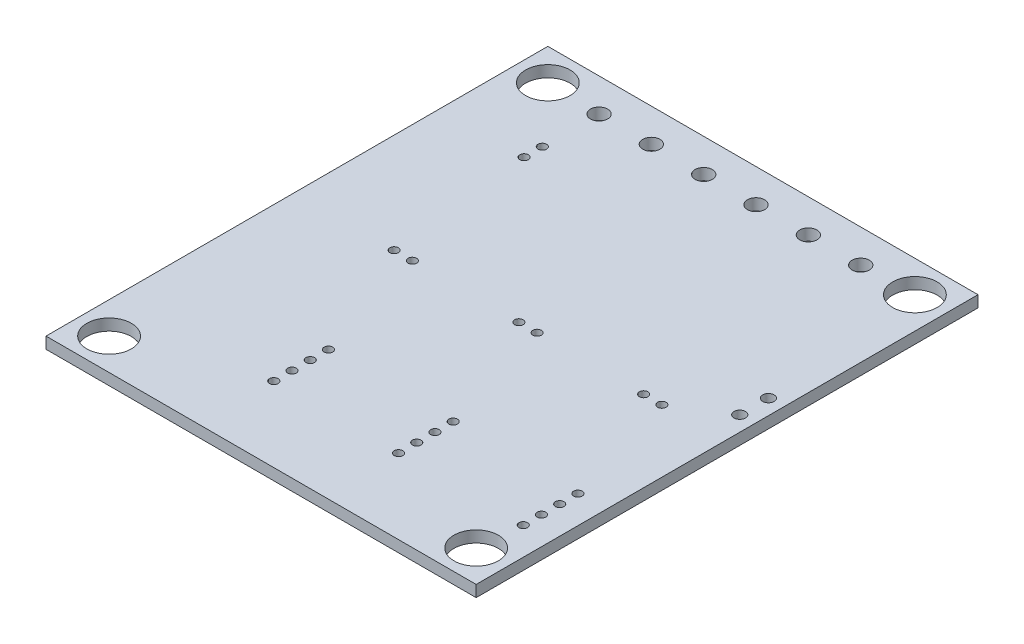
ISO-10303-21;
HEADER;
FILE_DESCRIPTION(('STEP AP214'),'2;1');
FILE_NAME('part.step','',(''),(''),'','','');
FILE_SCHEMA(('AUTOMOTIVE_DESIGN { 1 0 10303 214 1 1 1 1 }'));
ENDSEC;
DATA;
#1=APPLICATION_CONTEXT('core data for automotive mechanical design processes');
#2=APPLICATION_PROTOCOL_DEFINITION('international standard','automotive_design',2000,#1);
#3=PRODUCT_CONTEXT('',#1,'mechanical');
#4=PRODUCT('Part','Part','',(#3));
#5=PRODUCT_RELATED_PRODUCT_CATEGORY('part','',(#4));
#6=PRODUCT_DEFINITION_FORMATION('','',#4);
#7=PRODUCT_DEFINITION_CONTEXT('part definition',#1,'design');
#8=PRODUCT_DEFINITION('design','',#6,#7);
#9=PRODUCT_DEFINITION_SHAPE('','',#8);
#10=(LENGTH_UNIT() NAMED_UNIT(*) SI_UNIT(.MILLI.,.METRE.));
#11=(NAMED_UNIT(*) PLANE_ANGLE_UNIT() SI_UNIT($,.RADIAN.));
#12=(NAMED_UNIT(*) SI_UNIT($,.STERADIAN.) SOLID_ANGLE_UNIT());
#13=UNCERTAINTY_MEASURE_WITH_UNIT(LENGTH_MEASURE(1.E-05),#10,'distance_accuracy_value','');
#14=(GEOMETRIC_REPRESENTATION_CONTEXT(3) GLOBAL_UNCERTAINTY_ASSIGNED_CONTEXT((#13)) GLOBAL_UNIT_ASSIGNED_CONTEXT((#10,
#11,#12)) REPRESENTATION_CONTEXT('',''));
#15=CARTESIAN_POINT('',(0.,0.,0.));
#16=DIRECTION('',(0.,0.,1.));
#17=DIRECTION('',(1.,0.,0.));
#18=AXIS2_PLACEMENT_3D('',#15,#16,#17);
#19=CARTESIAN_POINT('',(-15.,0.,17.5));
#20=DIRECTION('',(0.,1.,0.));
#21=DIRECTION('',(0.,0.,1.));
#22=AXIS2_PLACEMENT_3D('',#19,#20,#21);
#23=PLANE('',#22);
#24=DIRECTION('',(0.,0.,-1.));
#25=VECTOR('',#24,1.);
#26=CARTESIAN_POINT('',(15.,0.,-17.5));
#27=LINE('',#26,#25);
#28=CARTESIAN_POINT('',(15.,0.,-17.5));
#29=VERTEX_POINT('',#28);
#30=CARTESIAN_POINT('',(15.,0.,17.5));
#31=VERTEX_POINT('',#30);
#32=EDGE_CURVE('E58',#29,#31,#27,.F.);
#33=ORIENTED_EDGE('',*,*,#32,.F.);
#34=DIRECTION('',(-1.,0.,0.));
#35=VECTOR('',#34,1.);
#36=CARTESIAN_POINT('',(-15.,0.,-17.5));
#37=LINE('',#36,#35);
#38=CARTESIAN_POINT('',(-15.,0.,-17.5));
#39=VERTEX_POINT('',#38);
#40=EDGE_CURVE('E53',#39,#29,#37,.F.);
#41=ORIENTED_EDGE('',*,*,#40,.F.);
#42=DIRECTION('',(0.,0.,1.));
#43=VECTOR('',#42,1.);
#44=CARTESIAN_POINT('',(-15.,0.,-17.5));
#45=LINE('',#44,#43);
#46=CARTESIAN_POINT('',(-15.,0.,17.5));
#47=VERTEX_POINT('',#46);
#48=EDGE_CURVE('E71',#47,#39,#45,.F.);
#49=ORIENTED_EDGE('',*,*,#48,.F.);
#50=DIRECTION('',(1.,0.,0.));
#51=VECTOR('',#50,1.);
#52=CARTESIAN_POINT('',(-15.,0.,17.5));
#53=LINE('',#52,#51);
#54=EDGE_CURVE('E67',#31,#47,#53,.F.);
#55=ORIENTED_EDGE('',*,*,#54,.F.);
#56=EDGE_LOOP('',(#33,#41,#49,#55));
#57=FACE_BOUND('',#56,.T.);
#58=CARTESIAN_POINT('',(-9.12499999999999,0.,-15.1951690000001));
#59=DIRECTION('',(0.,1.,0.));
#60=DIRECTION('',(0.,0.,1.));
#61=AXIS2_PLACEMENT_3D('',#58,#59,#60);
#62=CIRCLE('',#61,0.6);
#63=CARTESIAN_POINT('',(-9.12499999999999,0.,-14.5951690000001));
#64=VERTEX_POINT('',#63);
#65=EDGE_CURVE('E75',#64,#64,#62,.F.);
#66=ORIENTED_EDGE('',*,*,#65,.T.);
#67=EDGE_LOOP('',(#66));
#68=FACE_BOUND('',#67,.T.);
#69=CARTESIAN_POINT('',(-5.47500000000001,0.,-15.1951690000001));
#70=DIRECTION('',(0.,1.,0.));
#71=DIRECTION('',(0.,0.,1.));
#72=AXIS2_PLACEMENT_3D('',#69,#70,#71);
#73=CIRCLE('',#72,0.6);
#74=CARTESIAN_POINT('',(-5.47500000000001,0.,-14.5951690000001));
#75=VERTEX_POINT('',#74);
#76=EDGE_CURVE('E183',#75,#75,#73,.F.);
#77=ORIENTED_EDGE('',*,*,#76,.T.);
#78=EDGE_LOOP('',(#77));
#79=FACE_BOUND('',#78,.T.);
#80=CARTESIAN_POINT('',(-1.82499999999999,-1.2490009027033E-13,-15.1951690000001));
#81=DIRECTION('',(0.,1.,0.));
#82=DIRECTION('',(0.,0.,1.));
#83=AXIS2_PLACEMENT_3D('',#80,#81,#82);
#84=CIRCLE('',#83,0.6);
#85=CARTESIAN_POINT('',(-1.82499999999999,-1.24828540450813E-13,-14.5951690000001));
#86=VERTEX_POINT('',#85);
#87=EDGE_CURVE('E186',#86,#86,#84,.F.);
#88=ORIENTED_EDGE('',*,*,#87,.T.);
#89=EDGE_LOOP('',(#88));
#90=FACE_BOUND('',#89,.T.);
#91=CARTESIAN_POINT('',(1.82499999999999,0.,-15.1951690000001));
#92=DIRECTION('',(0.,1.,0.));
#93=DIRECTION('',(0.,0.,1.));
#94=AXIS2_PLACEMENT_3D('',#91,#92,#93);
#95=CIRCLE('',#94,0.6);
#96=CARTESIAN_POINT('',(1.82499999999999,0.,-14.5951690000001));
#97=VERTEX_POINT('',#96);
#98=EDGE_CURVE('E189',#97,#97,#95,.F.);
#99=ORIENTED_EDGE('',*,*,#98,.T.);
#100=EDGE_LOOP('',(#99));
#101=FACE_BOUND('',#100,.T.);
#102=CARTESIAN_POINT('',(5.47500000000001,0.,-15.1951690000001));
#103=DIRECTION('',(0.,1.,0.));
#104=DIRECTION('',(0.,0.,1.));
#105=AXIS2_PLACEMENT_3D('',#102,#103,#104);
#106=CIRCLE('',#105,0.6);
#107=CARTESIAN_POINT('',(5.47500000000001,0.,-14.5951690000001));
#108=VERTEX_POINT('',#107);
#109=EDGE_CURVE('E192',#108,#108,#106,.F.);
#110=ORIENTED_EDGE('',*,*,#109,.T.);
#111=EDGE_LOOP('',(#110));
#112=FACE_BOUND('',#111,.T.);
#113=CARTESIAN_POINT('',(9.12499999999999,-1.2490009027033E-13,-15.195169));
#114=DIRECTION('',(0.,1.,0.));
#115=DIRECTION('',(0.,0.,1.));
#116=AXIS2_PLACEMENT_3D('',#113,#114,#115);
#117=CIRCLE('',#116,0.6);
#118=CARTESIAN_POINT('',(9.12499999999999,-1.24828540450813E-13,-14.595169));
#119=VERTEX_POINT('',#118);
#120=EDGE_CURVE('E195',#119,#119,#117,.F.);
#121=ORIENTED_EDGE('',*,*,#120,.T.);
#122=EDGE_LOOP('',(#121));
#123=FACE_BOUND('',#122,.T.);
#124=CARTESIAN_POINT('',(-12.8,0.,-15.3));
#125=DIRECTION('',(0.,1.,0.));
#126=DIRECTION('',(0.,0.,1.));
#127=AXIS2_PLACEMENT_3D('',#124,#125,#126);
#128=CIRCLE('',#127,1.55);
#129=CARTESIAN_POINT('',(-12.8,0.,-13.75));
#130=VERTEX_POINT('',#129);
#131=EDGE_CURVE('E198',#130,#130,#128,.F.);
#132=ORIENTED_EDGE('',*,*,#131,.T.);
#133=EDGE_LOOP('',(#132));
#134=FACE_BOUND('',#133,.T.);
#135=CARTESIAN_POINT('',(-12.8,-1.2490009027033E-13,15.3));
#136=DIRECTION('',(0.,1.,0.));
#137=DIRECTION('',(0.,0.,1.));
#138=AXIS2_PLACEMENT_3D('',#135,#136,#137);
#139=CIRCLE('',#138,1.55);
#140=CARTESIAN_POINT('',(-12.8,-1.24715253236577E-13,16.85));
#141=VERTEX_POINT('',#140);
#142=EDGE_CURVE('E201',#141,#141,#139,.F.);
#143=ORIENTED_EDGE('',*,*,#142,.T.);
#144=EDGE_LOOP('',(#143));
#145=FACE_BOUND('',#144,.T.);
#146=CARTESIAN_POINT('',(12.8,-1.2490009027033E-13,15.3));
#147=DIRECTION('',(0.,1.,0.));
#148=DIRECTION('',(0.,0.,1.));
#149=AXIS2_PLACEMENT_3D('',#146,#147,#148);
#150=CIRCLE('',#149,1.55);
#151=CARTESIAN_POINT('',(12.8,-1.24715253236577E-13,16.85));
#152=VERTEX_POINT('',#151);
#153=EDGE_CURVE('E204',#152,#152,#150,.F.);
#154=ORIENTED_EDGE('',*,*,#153,.T.);
#155=EDGE_LOOP('',(#154));
#156=FACE_BOUND('',#155,.T.);
#157=CARTESIAN_POINT('',(12.8,0.,-15.3));
#158=DIRECTION('',(0.,1.,0.));
#159=DIRECTION('',(0.,0.,1.));
#160=AXIS2_PLACEMENT_3D('',#157,#158,#159);
#161=CIRCLE('',#160,1.55);
#162=CARTESIAN_POINT('',(12.8,0.,-13.75));
#163=VERTEX_POINT('',#162);
#164=EDGE_CURVE('E207',#163,#163,#161,.F.);
#165=ORIENTED_EDGE('',*,*,#164,.T.);
#166=EDGE_LOOP('',(#165));
#167=FACE_BOUND('',#166,.T.);
#168=CARTESIAN_POINT('',(1.92386300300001,0.,0.174116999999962));
#169=DIRECTION('',(0.,1.,0.));
#170=DIRECTION('',(0.,0.,1.));
#171=AXIS2_PLACEMENT_3D('',#168,#169,#170);
#172=CIRCLE('',#171,0.299999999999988);
#173=CARTESIAN_POINT('',(1.92386300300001,0.,0.474116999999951));
#174=VERTEX_POINT('',#173);
#175=EDGE_CURVE('E210',#174,#174,#172,.F.);
#176=ORIENTED_EDGE('',*,*,#175,.T.);
#177=EDGE_LOOP('',(#176));
#178=FACE_BOUND('',#177,.T.);
#179=CARTESIAN_POINT('',(13.062017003,0.,12.2762009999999));
#180=DIRECTION('',(0.,1.,0.));
#181=DIRECTION('',(0.,0.,1.));
#182=AXIS2_PLACEMENT_3D('',#179,#180,#181);
#183=CIRCLE('',#182,0.299999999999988);
#184=CARTESIAN_POINT('',(13.062017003,0.,12.5762009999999));
#185=VERTEX_POINT('',#184);
#186=EDGE_CURVE('E213',#185,#185,#183,.F.);
#187=ORIENTED_EDGE('',*,*,#186,.T.);
#188=EDGE_LOOP('',(#187));
#189=FACE_BOUND('',#188,.T.);
#190=CARTESIAN_POINT('',(13.062017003,0.,11.0062009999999));
#191=DIRECTION('',(0.,1.,0.));
#192=DIRECTION('',(0.,0.,1.));
#193=AXIS2_PLACEMENT_3D('',#190,#191,#192);
#194=CIRCLE('',#193,0.299999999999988);
#195=CARTESIAN_POINT('',(13.062017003,0.,11.3062009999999));
#196=VERTEX_POINT('',#195);
#197=EDGE_CURVE('E216',#196,#196,#194,.F.);
#198=ORIENTED_EDGE('',*,*,#197,.T.);
#199=EDGE_LOOP('',(#198));
#200=FACE_BOUND('',#199,.T.);
#201=CARTESIAN_POINT('',(13.062017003,-1.2490009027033E-13,9.73620099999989));
#202=DIRECTION('',(0.,1.,0.));
#203=DIRECTION('',(0.,0.,1.));
#204=AXIS2_PLACEMENT_3D('',#201,#202,#203);
#205=CIRCLE('',#204,0.299999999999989);
#206=CARTESIAN_POINT('',(13.062017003,-1.24864315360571E-13,10.0362009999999));
#207=VERTEX_POINT('',#206);
#208=EDGE_CURVE('E219',#207,#207,#205,.F.);
#209=ORIENTED_EDGE('',*,*,#208,.T.);
#210=EDGE_LOOP('',(#209));
#211=FACE_BOUND('',#210,.T.);
#212=CARTESIAN_POINT('',(13.062017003,-1.2490009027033E-13,8.46620099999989));
#213=DIRECTION('',(0.,1.,0.));
#214=DIRECTION('',(0.,0.,1.));
#215=AXIS2_PLACEMENT_3D('',#212,#213,#214);
#216=CIRCLE('',#215,0.299999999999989);
#217=CARTESIAN_POINT('',(13.062017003,-1.24864315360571E-13,8.76620099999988));
#218=VERTEX_POINT('',#217);
#219=EDGE_CURVE('E222',#218,#218,#216,.F.);
#220=ORIENTED_EDGE('',*,*,#219,.T.);
#221=EDGE_LOOP('',(#220));
#222=FACE_BOUND('',#221,.T.);
#223=CARTESIAN_POINT('',(4.362517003,0.,12.2762009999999));
#224=DIRECTION('',(0.,1.,0.));
#225=DIRECTION('',(0.,0.,1.));
#226=AXIS2_PLACEMENT_3D('',#223,#224,#225);
#227=CIRCLE('',#226,0.299999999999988);
#228=CARTESIAN_POINT('',(4.362517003,0.,12.5762009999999));
#229=VERTEX_POINT('',#228);
#230=EDGE_CURVE('E225',#229,#229,#227,.F.);
#231=ORIENTED_EDGE('',*,*,#230,.T.);
#232=EDGE_LOOP('',(#231));
#233=FACE_BOUND('',#232,.T.);
#234=CARTESIAN_POINT('',(4.362517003,0.,11.0062009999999));
#235=DIRECTION('',(0.,1.,0.));
#236=DIRECTION('',(0.,0.,1.));
#237=AXIS2_PLACEMENT_3D('',#234,#235,#236);
#238=CIRCLE('',#237,0.299999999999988);
#239=CARTESIAN_POINT('',(4.362517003,0.,11.3062009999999));
#240=VERTEX_POINT('',#239);
#241=EDGE_CURVE('E228',#240,#240,#238,.F.);
#242=ORIENTED_EDGE('',*,*,#241,.T.);
#243=EDGE_LOOP('',(#242));
#244=FACE_BOUND('',#243,.T.);
#245=CARTESIAN_POINT('',(4.362517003,-1.2490009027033E-13,9.73620099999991));
#246=DIRECTION('',(0.,1.,0.));
#247=DIRECTION('',(0.,0.,1.));
#248=AXIS2_PLACEMENT_3D('',#245,#246,#247);
#249=CIRCLE('',#248,0.299999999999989);
#250=CARTESIAN_POINT('',(4.362517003,-1.24864315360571E-13,10.0362009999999));
#251=VERTEX_POINT('',#250);
#252=EDGE_CURVE('E231',#251,#251,#249,.F.);
#253=ORIENTED_EDGE('',*,*,#252,.T.);
#254=EDGE_LOOP('',(#253));
#255=FACE_BOUND('',#254,.T.);
#256=CARTESIAN_POINT('',(4.362517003,-1.2490009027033E-13,8.4662009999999));
#257=DIRECTION('',(0.,1.,0.));
#258=DIRECTION('',(0.,0.,1.));
#259=AXIS2_PLACEMENT_3D('',#256,#257,#258);
#260=CIRCLE('',#259,0.299999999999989);
#261=CARTESIAN_POINT('',(4.362517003,-1.24864315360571E-13,8.76620099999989));
#262=VERTEX_POINT('',#261);
#263=EDGE_CURVE('E234',#262,#262,#260,.F.);
#264=ORIENTED_EDGE('',*,*,#263,.T.);
#265=EDGE_LOOP('',(#264));
#266=FACE_BOUND('',#265,.T.);
#267=CARTESIAN_POINT('',(-4.33698299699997,-1.2490009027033E-13,8.4662009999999));
#268=DIRECTION('',(0.,1.,0.));
#269=DIRECTION('',(0.,0.,1.));
#270=AXIS2_PLACEMENT_3D('',#267,#268,#269);
#271=CIRCLE('',#270,0.299999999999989);
#272=CARTESIAN_POINT('',(-4.33698299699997,-1.24864315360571E-13,8.76620099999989));
#273=VERTEX_POINT('',#272);
#274=EDGE_CURVE('E237',#273,#273,#271,.F.);
#275=ORIENTED_EDGE('',*,*,#274,.T.);
#276=EDGE_LOOP('',(#275));
#277=FACE_BOUND('',#276,.T.);
#278=CARTESIAN_POINT('',(-4.33698299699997,-1.2490009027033E-13,9.73620099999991));
#279=DIRECTION('',(0.,1.,0.));
#280=DIRECTION('',(0.,0.,1.));
#281=AXIS2_PLACEMENT_3D('',#278,#279,#280);
#282=CIRCLE('',#281,0.299999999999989);
#283=CARTESIAN_POINT('',(-4.33698299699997,-1.24864315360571E-13,10.0362009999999));
#284=VERTEX_POINT('',#283);
#285=EDGE_CURVE('E240',#284,#284,#282,.F.);
#286=ORIENTED_EDGE('',*,*,#285,.T.);
#287=EDGE_LOOP('',(#286));
#288=FACE_BOUND('',#287,.T.);
#289=CARTESIAN_POINT('',(-4.33698299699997,0.,11.0062009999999));
#290=DIRECTION('',(0.,1.,0.));
#291=DIRECTION('',(0.,0.,1.));
#292=AXIS2_PLACEMENT_3D('',#289,#290,#291);
#293=CIRCLE('',#292,0.299999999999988);
#294=CARTESIAN_POINT('',(-4.33698299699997,0.,11.3062009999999));
#295=VERTEX_POINT('',#294);
#296=EDGE_CURVE('E243',#295,#295,#293,.F.);
#297=ORIENTED_EDGE('',*,*,#296,.T.);
#298=EDGE_LOOP('',(#297));
#299=FACE_BOUND('',#298,.T.);
#300=CARTESIAN_POINT('',(-4.33698299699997,0.,12.2762009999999));
#301=DIRECTION('',(0.,1.,0.));
#302=DIRECTION('',(0.,0.,1.));
#303=AXIS2_PLACEMENT_3D('',#300,#301,#302);
#304=CIRCLE('',#303,0.299999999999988);
#305=CARTESIAN_POINT('',(-4.33698299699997,0.,12.5762009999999));
#306=VERTEX_POINT('',#305);
#307=EDGE_CURVE('E246',#306,#306,#304,.F.);
#308=ORIENTED_EDGE('',*,*,#307,.T.);
#309=EDGE_LOOP('',(#308));
#310=FACE_BOUND('',#309,.T.);
#311=CARTESIAN_POINT('',(10.623363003,0.,0.174116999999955));
#312=DIRECTION('',(0.,1.,0.));
#313=DIRECTION('',(0.,0.,1.));
#314=AXIS2_PLACEMENT_3D('',#311,#312,#313);
#315=CIRCLE('',#314,0.299999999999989);
#316=CARTESIAN_POINT('',(10.623363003,0.,0.474116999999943));
#317=VERTEX_POINT('',#316);
#318=EDGE_CURVE('E249',#317,#317,#315,.F.);
#319=ORIENTED_EDGE('',*,*,#318,.T.);
#320=EDGE_LOOP('',(#319));
#321=FACE_BOUND('',#320,.T.);
#322=CARTESIAN_POINT('',(9.35336300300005,-1.2490009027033E-13,0.174116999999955));
#323=DIRECTION('',(0.,1.,0.));
#324=DIRECTION('',(0.,0.,1.));
#325=AXIS2_PLACEMENT_3D('',#322,#323,#324);
#326=CIRCLE('',#325,0.299999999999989);
#327=CARTESIAN_POINT('',(9.35336300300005,-1.24864315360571E-13,0.474116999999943));
#328=VERTEX_POINT('',#327);
#329=EDGE_CURVE('E252',#328,#328,#326,.F.);
#330=ORIENTED_EDGE('',*,*,#329,.T.);
#331=EDGE_LOOP('',(#330));
#332=FACE_BOUND('',#331,.T.);
#333=CARTESIAN_POINT('',(0.653863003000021,0.,0.174116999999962));
#334=DIRECTION('',(0.,1.,0.));
#335=DIRECTION('',(0.,0.,1.));
#336=AXIS2_PLACEMENT_3D('',#333,#334,#335);
#337=CIRCLE('',#336,0.299999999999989);
#338=CARTESIAN_POINT('',(0.653863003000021,0.,0.474116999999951));
#339=VERTEX_POINT('',#338);
#340=EDGE_CURVE('E255',#339,#339,#337,.F.);
#341=ORIENTED_EDGE('',*,*,#340,.T.);
#342=EDGE_LOOP('',(#341));
#343=FACE_BOUND('',#342,.T.);
#344=CARTESIAN_POINT('',(-6.77563699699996,0.,0.174116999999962));
#345=DIRECTION('',(0.,1.,0.));
#346=DIRECTION('',(0.,0.,1.));
#347=AXIS2_PLACEMENT_3D('',#344,#345,#346);
#348=CIRCLE('',#347,0.299999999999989);
#349=CARTESIAN_POINT('',(-6.77563699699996,0.,0.474116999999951));
#350=VERTEX_POINT('',#349);
#351=EDGE_CURVE('E258',#350,#350,#348,.F.);
#352=ORIENTED_EDGE('',*,*,#351,.T.);
#353=EDGE_LOOP('',(#352));
#354=FACE_BOUND('',#353,.T.);
#355=CARTESIAN_POINT('',(-8.04563699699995,0.,0.174116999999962));
#356=DIRECTION('',(0.,1.,0.));
#357=DIRECTION('',(0.,0.,1.));
#358=AXIS2_PLACEMENT_3D('',#355,#356,#357);
#359=CIRCLE('',#358,0.299999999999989);
#360=CARTESIAN_POINT('',(-8.04563699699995,0.,0.474116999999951));
#361=VERTEX_POINT('',#360);
#362=EDGE_CURVE('E261',#361,#361,#359,.F.);
#363=ORIENTED_EDGE('',*,*,#362,.T.);
#364=EDGE_LOOP('',(#363));
#365=FACE_BOUND('',#364,.T.);
#366=CARTESIAN_POINT('',(-9.131232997,0.,-9.9736910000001));
#367=DIRECTION('',(0.,1.,0.));
#368=DIRECTION('',(0.,0.,1.));
#369=AXIS2_PLACEMENT_3D('',#366,#367,#368);
#370=CIRCLE('',#369,0.299999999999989);
#371=CARTESIAN_POINT('',(-9.131232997,0.,-9.67369100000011));
#372=VERTEX_POINT('',#371);
#373=EDGE_CURVE('E264',#372,#372,#370,.F.);
#374=ORIENTED_EDGE('',*,*,#373,.T.);
#375=EDGE_LOOP('',(#374));
#376=FACE_BOUND('',#375,.T.);
#377=CARTESIAN_POINT('',(-9.131232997,0.,-11.2436910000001));
#378=DIRECTION('',(0.,1.,0.));
#379=DIRECTION('',(0.,0.,1.));
#380=AXIS2_PLACEMENT_3D('',#377,#378,#379);
#381=CIRCLE('',#380,0.299999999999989);
#382=CARTESIAN_POINT('',(-9.131232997,0.,-10.9436910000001));
#383=VERTEX_POINT('',#382);
#384=EDGE_CURVE('E267',#383,#383,#381,.F.);
#385=ORIENTED_EDGE('',*,*,#384,.T.);
#386=EDGE_LOOP('',(#385));
#387=FACE_BOUND('',#386,.T.);
#388=CARTESIAN_POINT('',(13.94,-1.2490009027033E-13,-3.94093900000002));
#389=DIRECTION('',(0.,1.,0.));
#390=DIRECTION('',(0.,0.,1.));
#391=AXIS2_PLACEMENT_3D('',#388,#389,#390);
#392=CIRCLE('',#391,0.4);
#393=CARTESIAN_POINT('',(13.94,-1.24852390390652E-13,-3.54093900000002));
#394=VERTEX_POINT('',#393);
#395=EDGE_CURVE('E269',#394,#394,#392,.F.);
#396=ORIENTED_EDGE('',*,*,#395,.T.);
#397=EDGE_LOOP('',(#396));
#398=FACE_BOUND('',#397,.T.);
#399=CARTESIAN_POINT('',(13.94,0.,-1.94093900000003));
#400=DIRECTION('',(0.,1.,0.));
#401=DIRECTION('',(0.,0.,1.));
#402=AXIS2_PLACEMENT_3D('',#399,#400,#401);
#403=CIRCLE('',#402,0.4);
#404=CARTESIAN_POINT('',(13.94,0.,-1.54093900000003));
#405=VERTEX_POINT('',#404);
#406=EDGE_CURVE('E20',#405,#405,#403,.F.);
#407=ORIENTED_EDGE('',*,*,#406,.T.);
#408=EDGE_LOOP('',(#407));
#409=FACE_BOUND('',#408,.T.);
#410=ADVANCED_FACE('F17',(#57,#68,#79,#90,#101,#112,#123,#134,#145,#156,#167,#178,#189,#200,
#211,#222,#233,#244,#255,#266,#277,#288,#299,#310,#321,#332,#343,#354,#365,#376,#387,#398,#409),
#23,.T.);
#411=CARTESIAN_POINT('',(13.94,-1.,-1.94093900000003));
#412=DIRECTION('',(0.,1.,0.));
#413=DIRECTION('',(0.,0.,1.));
#414=AXIS2_PLACEMENT_3D('',#411,#412,#413);
#415=CYLINDRICAL_SURFACE('',#414,0.4);
#416=CARTESIAN_POINT('',(13.94,-0.800000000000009,-1.94093900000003));
#417=DIRECTION('',(0.,1.,0.));
#418=DIRECTION('',(0.,0.,1.));
#419=AXIS2_PLACEMENT_3D('',#416,#417,#418);
#420=CIRCLE('',#419,0.4);
#421=CARTESIAN_POINT('',(13.94,-0.800000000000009,-1.54093900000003));
#422=VERTEX_POINT('',#421);
#423=EDGE_CURVE('E177',#422,#422,#420,.F.);
#424=ORIENTED_EDGE('',*,*,#423,.T.);
#425=EDGE_LOOP('',(#424));
#426=FACE_BOUND('',#425,.T.);
#427=ORIENTED_EDGE('',*,*,#406,.F.);
#428=EDGE_LOOP('',(#427));
#429=FACE_BOUND('',#428,.T.);
#430=ADVANCED_FACE('F277',(#426,#429),#415,.F.);
#431=CARTESIAN_POINT('',(13.94,-1.00000000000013,-3.94093900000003));
#432=DIRECTION('',(0.,1.,0.));
#433=DIRECTION('',(0.,0.,1.));
#434=AXIS2_PLACEMENT_3D('',#431,#432,#433);
#435=CYLINDRICAL_SURFACE('',#434,0.4);
#436=CARTESIAN_POINT('',(13.94,-0.80000000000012,-3.94093900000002));
#437=DIRECTION('',(0.,1.,0.));
#438=DIRECTION('',(0.,0.,1.));
#439=AXIS2_PLACEMENT_3D('',#436,#437,#438);
#440=CIRCLE('',#439,0.4);
#441=CARTESIAN_POINT('',(13.94,-0.80000000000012,-3.54093900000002));
#442=VERTEX_POINT('',#441);
#443=EDGE_CURVE('E174',#442,#442,#440,.F.);
#444=ORIENTED_EDGE('',*,*,#443,.T.);
#445=EDGE_LOOP('',(#444));
#446=FACE_BOUND('',#445,.T.);
#447=ORIENTED_EDGE('',*,*,#395,.F.);
#448=EDGE_LOOP('',(#447));
#449=FACE_BOUND('',#448,.T.);
#450=ADVANCED_FACE('F279',(#446,#449),#435,.F.);
#451=CARTESIAN_POINT('',(-9.131232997,0.,-11.2436910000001));
#452=DIRECTION('',(0.,1.,0.));
#453=DIRECTION('',(0.,0.,1.));
#454=AXIS2_PLACEMENT_3D('',#451,#452,#453);
#455=CYLINDRICAL_SURFACE('',#454,0.299999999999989);
#456=CARTESIAN_POINT('',(-9.131232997,-0.800000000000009,-11.2436910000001));
#457=DIRECTION('',(0.,1.,0.));
#458=DIRECTION('',(0.,0.,1.));
#459=AXIS2_PLACEMENT_3D('',#456,#457,#458);
#460=CIRCLE('',#459,0.299999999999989);
#461=CARTESIAN_POINT('',(-9.131232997,-0.800000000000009,-10.9436910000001));
#462=VERTEX_POINT('',#461);
#463=EDGE_CURVE('E171',#462,#462,#460,.F.);
#464=ORIENTED_EDGE('',*,*,#463,.T.);
#465=EDGE_LOOP('',(#464));
#466=FACE_BOUND('',#465,.T.);
#467=ORIENTED_EDGE('',*,*,#384,.F.);
#468=EDGE_LOOP('',(#467));
#469=FACE_BOUND('',#468,.T.);
#470=ADVANCED_FACE('F286',(#466,#469),#455,.F.);
#471=CARTESIAN_POINT('',(-9.131232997,0.,-9.9736910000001));
#472=DIRECTION('',(0.,1.,0.));
#473=DIRECTION('',(0.,0.,1.));
#474=AXIS2_PLACEMENT_3D('',#471,#472,#473);
#475=CYLINDRICAL_SURFACE('',#474,0.299999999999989);
#476=CARTESIAN_POINT('',(-9.131232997,-0.799999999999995,-9.97369100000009));
#477=DIRECTION('',(0.,1.,0.));
#478=DIRECTION('',(0.,0.,1.));
#479=AXIS2_PLACEMENT_3D('',#476,#477,#478);
#480=CIRCLE('',#479,0.299999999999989);
#481=CARTESIAN_POINT('',(-9.131232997,-0.799999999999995,-9.6736910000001));
#482=VERTEX_POINT('',#481);
#483=EDGE_CURVE('E168',#482,#482,#480,.F.);
#484=ORIENTED_EDGE('',*,*,#483,.T.);
#485=EDGE_LOOP('',(#484));
#486=FACE_BOUND('',#485,.T.);
#487=ORIENTED_EDGE('',*,*,#373,.F.);
#488=EDGE_LOOP('',(#487));
#489=FACE_BOUND('',#488,.T.);
#490=ADVANCED_FACE('F419',(#486,#489),#475,.F.);
#491=CARTESIAN_POINT('',(-8.04563699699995,0.,0.174116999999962));
#492=DIRECTION('',(0.,1.,0.));
#493=DIRECTION('',(0.,0.,1.));
#494=AXIS2_PLACEMENT_3D('',#491,#492,#493);
#495=CYLINDRICAL_SURFACE('',#494,0.299999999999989);
#496=CARTESIAN_POINT('',(-8.04563699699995,-0.799999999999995,0.174116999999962));
#497=DIRECTION('',(0.,1.,0.));
#498=DIRECTION('',(0.,0.,1.));
#499=AXIS2_PLACEMENT_3D('',#496,#497,#498);
#500=CIRCLE('',#499,0.299999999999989);
#501=CARTESIAN_POINT('',(-8.04563699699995,-0.799999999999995,0.474116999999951));
#502=VERTEX_POINT('',#501);
#503=EDGE_CURVE('E165',#502,#502,#500,.F.);
#504=ORIENTED_EDGE('',*,*,#503,.T.);
#505=EDGE_LOOP('',(#504));
#506=FACE_BOUND('',#505,.T.);
#507=ORIENTED_EDGE('',*,*,#362,.F.);
#508=EDGE_LOOP('',(#507));
#509=FACE_BOUND('',#508,.T.);
#510=ADVANCED_FACE('F415',(#506,#509),#495,.F.);
#511=CARTESIAN_POINT('',(-6.77563699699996,0.,0.174116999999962));
#512=DIRECTION('',(0.,1.,0.));
#513=DIRECTION('',(0.,0.,1.));
#514=AXIS2_PLACEMENT_3D('',#511,#512,#513);
#515=CYLINDRICAL_SURFACE('',#514,0.299999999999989);
#516=CARTESIAN_POINT('',(-6.77563699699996,-0.800000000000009,0.174116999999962));
#517=DIRECTION('',(0.,1.,0.));
#518=DIRECTION('',(0.,0.,1.));
#519=AXIS2_PLACEMENT_3D('',#516,#517,#518);
#520=CIRCLE('',#519,0.299999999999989);
#521=CARTESIAN_POINT('',(-6.77563699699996,-0.800000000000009,0.474116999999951));
#522=VERTEX_POINT('',#521);
#523=EDGE_CURVE('E162',#522,#522,#520,.F.);
#524=ORIENTED_EDGE('',*,*,#523,.T.);
#525=EDGE_LOOP('',(#524));
#526=FACE_BOUND('',#525,.T.);
#527=ORIENTED_EDGE('',*,*,#351,.F.);
#528=EDGE_LOOP('',(#527));
#529=FACE_BOUND('',#528,.T.);
#530=ADVANCED_FACE('F411',(#526,#529),#515,.F.);
#531=CARTESIAN_POINT('',(0.653863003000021,0.,0.174116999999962));
#532=DIRECTION('',(0.,1.,0.));
#533=DIRECTION('',(0.,0.,1.));
#534=AXIS2_PLACEMENT_3D('',#531,#532,#533);
#535=CYLINDRICAL_SURFACE('',#534,0.299999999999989);
#536=CARTESIAN_POINT('',(0.653863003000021,-0.799999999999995,0.174116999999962));
#537=DIRECTION('',(0.,1.,0.));
#538=DIRECTION('',(0.,0.,1.));
#539=AXIS2_PLACEMENT_3D('',#536,#537,#538);
#540=CIRCLE('',#539,0.299999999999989);
#541=CARTESIAN_POINT('',(0.653863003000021,-0.799999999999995,0.474116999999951));
#542=VERTEX_POINT('',#541);
#543=EDGE_CURVE('E159',#542,#542,#540,.F.);
#544=ORIENTED_EDGE('',*,*,#543,.T.);
#545=EDGE_LOOP('',(#544));
#546=FACE_BOUND('',#545,.T.);
#547=ORIENTED_EDGE('',*,*,#340,.F.);
#548=EDGE_LOOP('',(#547));
#549=FACE_BOUND('',#548,.T.);
#550=ADVANCED_FACE('F407',(#546,#549),#535,.F.);
#551=CARTESIAN_POINT('',(9.35336300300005,-1.2490009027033E-13,0.174116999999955));
#552=DIRECTION('',(0.,1.,0.));
#553=DIRECTION('',(0.,0.,1.));
#554=AXIS2_PLACEMENT_3D('',#551,#552,#553);
#555=CYLINDRICAL_SURFACE('',#554,0.299999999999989);
#556=CARTESIAN_POINT('',(9.35336300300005,-0.80000000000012,0.174116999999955));
#557=DIRECTION('',(0.,1.,0.));
#558=DIRECTION('',(0.,0.,1.));
#559=AXIS2_PLACEMENT_3D('',#556,#557,#558);
#560=CIRCLE('',#559,0.299999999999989);
#561=CARTESIAN_POINT('',(9.35336300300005,-0.80000000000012,0.474116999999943));
#562=VERTEX_POINT('',#561);
#563=EDGE_CURVE('E156',#562,#562,#560,.F.);
#564=ORIENTED_EDGE('',*,*,#563,.T.);
#565=EDGE_LOOP('',(#564));
#566=FACE_BOUND('',#565,.T.);
#567=ORIENTED_EDGE('',*,*,#329,.F.);
#568=EDGE_LOOP('',(#567));
#569=FACE_BOUND('',#568,.T.);
#570=ADVANCED_FACE('F403',(#566,#569),#555,.F.);
#571=CARTESIAN_POINT('',(10.623363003,0.,0.174116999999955));
#572=DIRECTION('',(0.,1.,0.));
#573=DIRECTION('',(0.,0.,1.));
#574=AXIS2_PLACEMENT_3D('',#571,#572,#573);
#575=CYLINDRICAL_SURFACE('',#574,0.299999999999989);
#576=CARTESIAN_POINT('',(10.623363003,-0.800000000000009,0.174116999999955));
#577=DIRECTION('',(0.,1.,0.));
#578=DIRECTION('',(0.,0.,1.));
#579=AXIS2_PLACEMENT_3D('',#576,#577,#578);
#580=CIRCLE('',#579,0.299999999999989);
#581=CARTESIAN_POINT('',(10.623363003,-0.800000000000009,0.474116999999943));
#582=VERTEX_POINT('',#581);
#583=EDGE_CURVE('E153',#582,#582,#580,.F.);
#584=ORIENTED_EDGE('',*,*,#583,.T.);
#585=EDGE_LOOP('',(#584));
#586=FACE_BOUND('',#585,.T.);
#587=ORIENTED_EDGE('',*,*,#318,.F.);
#588=EDGE_LOOP('',(#587));
#589=FACE_BOUND('',#588,.T.);
#590=ADVANCED_FACE('F399',(#586,#589),#575,.F.);
#591=CARTESIAN_POINT('',(-4.33698299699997,0.,12.2762009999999));
#592=DIRECTION('',(0.,1.,0.));
#593=DIRECTION('',(0.,0.,1.));
#594=AXIS2_PLACEMENT_3D('',#591,#592,#593);
#595=CYLINDRICAL_SURFACE('',#594,0.299999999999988);
#596=CARTESIAN_POINT('',(-4.33698299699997,-0.800000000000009,12.2762009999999));
#597=DIRECTION('',(0.,1.,0.));
#598=DIRECTION('',(0.,0.,1.));
#599=AXIS2_PLACEMENT_3D('',#596,#597,#598);
#600=CIRCLE('',#599,0.299999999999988);
#601=CARTESIAN_POINT('',(-4.33698299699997,-0.800000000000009,12.5762009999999));
#602=VERTEX_POINT('',#601);
#603=EDGE_CURVE('E150',#602,#602,#600,.F.);
#604=ORIENTED_EDGE('',*,*,#603,.T.);
#605=EDGE_LOOP('',(#604));
#606=FACE_BOUND('',#605,.T.);
#607=ORIENTED_EDGE('',*,*,#307,.F.);
#608=EDGE_LOOP('',(#607));
#609=FACE_BOUND('',#608,.T.);
#610=ADVANCED_FACE('F395',(#606,#609),#595,.F.);
#611=CARTESIAN_POINT('',(-4.33698299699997,0.,11.0062009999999));
#612=DIRECTION('',(0.,1.,0.));
#613=DIRECTION('',(0.,0.,1.));
#614=AXIS2_PLACEMENT_3D('',#611,#612,#613);
#615=CYLINDRICAL_SURFACE('',#614,0.299999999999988);
#616=CARTESIAN_POINT('',(-4.33698299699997,-0.799999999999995,11.0062009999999));
#617=DIRECTION('',(0.,1.,0.));
#618=DIRECTION('',(0.,0.,1.));
#619=AXIS2_PLACEMENT_3D('',#616,#617,#618);
#620=CIRCLE('',#619,0.299999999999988);
#621=CARTESIAN_POINT('',(-4.33698299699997,-0.799999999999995,11.3062009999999));
#622=VERTEX_POINT('',#621);
#623=EDGE_CURVE('E147',#622,#622,#620,.F.);
#624=ORIENTED_EDGE('',*,*,#623,.T.);
#625=EDGE_LOOP('',(#624));
#626=FACE_BOUND('',#625,.T.);
#627=ORIENTED_EDGE('',*,*,#296,.F.);
#628=EDGE_LOOP('',(#627));
#629=FACE_BOUND('',#628,.T.);
#630=ADVANCED_FACE('F391',(#626,#629),#615,.F.);
#631=CARTESIAN_POINT('',(-4.33698299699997,-1.2490009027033E-13,9.73620099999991));
#632=DIRECTION('',(0.,1.,0.));
#633=DIRECTION('',(0.,0.,1.));
#634=AXIS2_PLACEMENT_3D('',#631,#632,#633);
#635=CYLINDRICAL_SURFACE('',#634,0.299999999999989);
#636=CARTESIAN_POINT('',(-4.33698299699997,-0.80000000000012,9.73620099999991));
#637=DIRECTION('',(0.,1.,0.));
#638=DIRECTION('',(0.,0.,1.));
#639=AXIS2_PLACEMENT_3D('',#636,#637,#638);
#640=CIRCLE('',#639,0.299999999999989);
#641=CARTESIAN_POINT('',(-4.33698299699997,-0.80000000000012,10.0362009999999));
#642=VERTEX_POINT('',#641);
#643=EDGE_CURVE('E144',#642,#642,#640,.F.);
#644=ORIENTED_EDGE('',*,*,#643,.T.);
#645=EDGE_LOOP('',(#644));
#646=FACE_BOUND('',#645,.T.);
#647=ORIENTED_EDGE('',*,*,#285,.F.);
#648=EDGE_LOOP('',(#647));
#649=FACE_BOUND('',#648,.T.);
#650=ADVANCED_FACE('F387',(#646,#649),#635,.F.);
#651=CARTESIAN_POINT('',(-4.33698299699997,-1.2490009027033E-13,8.4662009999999));
#652=DIRECTION('',(0.,1.,0.));
#653=DIRECTION('',(0.,0.,1.));
#654=AXIS2_PLACEMENT_3D('',#651,#652,#653);
#655=CYLINDRICAL_SURFACE('',#654,0.299999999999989);
#656=CARTESIAN_POINT('',(-4.33698299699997,-0.80000000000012,8.4662009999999));
#657=DIRECTION('',(0.,1.,0.));
#658=DIRECTION('',(0.,0.,1.));
#659=AXIS2_PLACEMENT_3D('',#656,#657,#658);
#660=CIRCLE('',#659,0.299999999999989);
#661=CARTESIAN_POINT('',(-4.33698299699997,-0.80000000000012,8.76620099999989));
#662=VERTEX_POINT('',#661);
#663=EDGE_CURVE('E141',#662,#662,#660,.F.);
#664=ORIENTED_EDGE('',*,*,#663,.T.);
#665=EDGE_LOOP('',(#664));
#666=FACE_BOUND('',#665,.T.);
#667=ORIENTED_EDGE('',*,*,#274,.F.);
#668=EDGE_LOOP('',(#667));
#669=FACE_BOUND('',#668,.T.);
#670=ADVANCED_FACE('F383',(#666,#669),#655,.F.);
#671=CARTESIAN_POINT('',(4.362517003,-1.2490009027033E-13,8.4662009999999));
#672=DIRECTION('',(0.,1.,0.));
#673=DIRECTION('',(0.,0.,1.));
#674=AXIS2_PLACEMENT_3D('',#671,#672,#673);
#675=CYLINDRICAL_SURFACE('',#674,0.299999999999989);
#676=CARTESIAN_POINT('',(4.362517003,-0.80000000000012,8.4662009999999));
#677=DIRECTION('',(0.,1.,0.));
#678=DIRECTION('',(0.,0.,1.));
#679=AXIS2_PLACEMENT_3D('',#676,#677,#678);
#680=CIRCLE('',#679,0.299999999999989);
#681=CARTESIAN_POINT('',(4.362517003,-0.80000000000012,8.76620099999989));
#682=VERTEX_POINT('',#681);
#683=EDGE_CURVE('E138',#682,#682,#680,.F.);
#684=ORIENTED_EDGE('',*,*,#683,.T.);
#685=EDGE_LOOP('',(#684));
#686=FACE_BOUND('',#685,.T.);
#687=ORIENTED_EDGE('',*,*,#263,.F.);
#688=EDGE_LOOP('',(#687));
#689=FACE_BOUND('',#688,.T.);
#690=ADVANCED_FACE('F379',(#686,#689),#675,.F.);
#691=CARTESIAN_POINT('',(4.362517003,-1.2490009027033E-13,9.73620099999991));
#692=DIRECTION('',(0.,1.,0.));
#693=DIRECTION('',(0.,0.,1.));
#694=AXIS2_PLACEMENT_3D('',#691,#692,#693);
#695=CYLINDRICAL_SURFACE('',#694,0.299999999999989);
#696=CARTESIAN_POINT('',(4.362517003,-0.80000000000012,9.73620099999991));
#697=DIRECTION('',(0.,1.,0.));
#698=DIRECTION('',(0.,0.,1.));
#699=AXIS2_PLACEMENT_3D('',#696,#697,#698);
#700=CIRCLE('',#699,0.299999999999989);
#701=CARTESIAN_POINT('',(4.362517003,-0.80000000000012,10.0362009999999));
#702=VERTEX_POINT('',#701);
#703=EDGE_CURVE('E135',#702,#702,#700,.F.);
#704=ORIENTED_EDGE('',*,*,#703,.T.);
#705=EDGE_LOOP('',(#704));
#706=FACE_BOUND('',#705,.T.);
#707=ORIENTED_EDGE('',*,*,#252,.F.);
#708=EDGE_LOOP('',(#707));
#709=FACE_BOUND('',#708,.T.);
#710=ADVANCED_FACE('F375',(#706,#709),#695,.F.);
#711=CARTESIAN_POINT('',(4.362517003,0.,11.0062009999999));
#712=DIRECTION('',(0.,1.,0.));
#713=DIRECTION('',(0.,0.,1.));
#714=AXIS2_PLACEMENT_3D('',#711,#712,#713);
#715=CYLINDRICAL_SURFACE('',#714,0.299999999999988);
#716=CARTESIAN_POINT('',(4.362517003,-0.799999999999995,11.0062009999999));
#717=DIRECTION('',(0.,1.,0.));
#718=DIRECTION('',(0.,0.,1.));
#719=AXIS2_PLACEMENT_3D('',#716,#717,#718);
#720=CIRCLE('',#719,0.299999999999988);
#721=CARTESIAN_POINT('',(4.362517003,-0.799999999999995,11.3062009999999));
#722=VERTEX_POINT('',#721);
#723=EDGE_CURVE('E132',#722,#722,#720,.F.);
#724=ORIENTED_EDGE('',*,*,#723,.T.);
#725=EDGE_LOOP('',(#724));
#726=FACE_BOUND('',#725,.T.);
#727=ORIENTED_EDGE('',*,*,#241,.F.);
#728=EDGE_LOOP('',(#727));
#729=FACE_BOUND('',#728,.T.);
#730=ADVANCED_FACE('F371',(#726,#729),#715,.F.);
#731=CARTESIAN_POINT('',(4.362517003,0.,12.2762009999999));
#732=DIRECTION('',(0.,1.,0.));
#733=DIRECTION('',(0.,0.,1.));
#734=AXIS2_PLACEMENT_3D('',#731,#732,#733);
#735=CYLINDRICAL_SURFACE('',#734,0.299999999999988);
#736=CARTESIAN_POINT('',(4.362517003,-0.800000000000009,12.2762009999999));
#737=DIRECTION('',(0.,1.,0.));
#738=DIRECTION('',(0.,0.,1.));
#739=AXIS2_PLACEMENT_3D('',#736,#737,#738);
#740=CIRCLE('',#739,0.299999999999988);
#741=CARTESIAN_POINT('',(4.362517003,-0.800000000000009,12.5762009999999));
#742=VERTEX_POINT('',#741);
#743=EDGE_CURVE('E129',#742,#742,#740,.F.);
#744=ORIENTED_EDGE('',*,*,#743,.T.);
#745=EDGE_LOOP('',(#744));
#746=FACE_BOUND('',#745,.T.);
#747=ORIENTED_EDGE('',*,*,#230,.F.);
#748=EDGE_LOOP('',(#747));
#749=FACE_BOUND('',#748,.T.);
#750=ADVANCED_FACE('F367',(#746,#749),#735,.F.);
#751=CARTESIAN_POINT('',(13.062017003,-1.2490009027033E-13,8.46620099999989));
#752=DIRECTION('',(0.,1.,0.));
#753=DIRECTION('',(0.,0.,1.));
#754=AXIS2_PLACEMENT_3D('',#751,#752,#753);
#755=CYLINDRICAL_SURFACE('',#754,0.299999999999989);
#756=CARTESIAN_POINT('',(13.062017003,-0.80000000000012,8.46620099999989));
#757=DIRECTION('',(0.,1.,0.));
#758=DIRECTION('',(0.,0.,1.));
#759=AXIS2_PLACEMENT_3D('',#756,#757,#758);
#760=CIRCLE('',#759,0.299999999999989);
#761=CARTESIAN_POINT('',(13.062017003,-0.80000000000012,8.76620099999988));
#762=VERTEX_POINT('',#761);
#763=EDGE_CURVE('E126',#762,#762,#760,.F.);
#764=ORIENTED_EDGE('',*,*,#763,.T.);
#765=EDGE_LOOP('',(#764));
#766=FACE_BOUND('',#765,.T.);
#767=ORIENTED_EDGE('',*,*,#219,.F.);
#768=EDGE_LOOP('',(#767));
#769=FACE_BOUND('',#768,.T.);
#770=ADVANCED_FACE('F363',(#766,#769),#755,.F.);
#771=CARTESIAN_POINT('',(13.062017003,-1.2490009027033E-13,9.73620099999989));
#772=DIRECTION('',(0.,1.,0.));
#773=DIRECTION('',(0.,0.,1.));
#774=AXIS2_PLACEMENT_3D('',#771,#772,#773);
#775=CYLINDRICAL_SURFACE('',#774,0.299999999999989);
#776=CARTESIAN_POINT('',(13.062017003,-0.80000000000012,9.73620099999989));
#777=DIRECTION('',(0.,1.,0.));
#778=DIRECTION('',(0.,0.,1.));
#779=AXIS2_PLACEMENT_3D('',#776,#777,#778);
#780=CIRCLE('',#779,0.299999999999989);
#781=CARTESIAN_POINT('',(13.062017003,-0.80000000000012,10.0362009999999));
#782=VERTEX_POINT('',#781);
#783=EDGE_CURVE('E123',#782,#782,#780,.F.);
#784=ORIENTED_EDGE('',*,*,#783,.T.);
#785=EDGE_LOOP('',(#784));
#786=FACE_BOUND('',#785,.T.);
#787=ORIENTED_EDGE('',*,*,#208,.F.);
#788=EDGE_LOOP('',(#787));
#789=FACE_BOUND('',#788,.T.);
#790=ADVANCED_FACE('F359',(#786,#789),#775,.F.);
#791=CARTESIAN_POINT('',(13.062017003,0.,11.0062009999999));
#792=DIRECTION('',(0.,1.,0.));
#793=DIRECTION('',(0.,0.,1.));
#794=AXIS2_PLACEMENT_3D('',#791,#792,#793);
#795=CYLINDRICAL_SURFACE('',#794,0.299999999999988);
#796=CARTESIAN_POINT('',(13.062017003,-0.799999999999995,11.0062009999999));
#797=DIRECTION('',(0.,1.,0.));
#798=DIRECTION('',(0.,0.,1.));
#799=AXIS2_PLACEMENT_3D('',#796,#797,#798);
#800=CIRCLE('',#799,0.299999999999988);
#801=CARTESIAN_POINT('',(13.062017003,-0.799999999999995,11.3062009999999));
#802=VERTEX_POINT('',#801);
#803=EDGE_CURVE('E120',#802,#802,#800,.F.);
#804=ORIENTED_EDGE('',*,*,#803,.T.);
#805=EDGE_LOOP('',(#804));
#806=FACE_BOUND('',#805,.T.);
#807=ORIENTED_EDGE('',*,*,#197,.F.);
#808=EDGE_LOOP('',(#807));
#809=FACE_BOUND('',#808,.T.);
#810=ADVANCED_FACE('F355',(#806,#809),#795,.F.);
#811=CARTESIAN_POINT('',(13.062017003,0.,12.2762009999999));
#812=DIRECTION('',(0.,1.,0.));
#813=DIRECTION('',(0.,0.,1.));
#814=AXIS2_PLACEMENT_3D('',#811,#812,#813);
#815=CYLINDRICAL_SURFACE('',#814,0.299999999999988);
#816=CARTESIAN_POINT('',(13.062017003,-0.800000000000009,12.2762009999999));
#817=DIRECTION('',(0.,1.,0.));
#818=DIRECTION('',(0.,0.,1.));
#819=AXIS2_PLACEMENT_3D('',#816,#817,#818);
#820=CIRCLE('',#819,0.299999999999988);
#821=CARTESIAN_POINT('',(13.062017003,-0.800000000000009,12.5762009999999));
#822=VERTEX_POINT('',#821);
#823=EDGE_CURVE('E117',#822,#822,#820,.F.);
#824=ORIENTED_EDGE('',*,*,#823,.T.);
#825=EDGE_LOOP('',(#824));
#826=FACE_BOUND('',#825,.T.);
#827=ORIENTED_EDGE('',*,*,#186,.F.);
#828=EDGE_LOOP('',(#827));
#829=FACE_BOUND('',#828,.T.);
#830=ADVANCED_FACE('F351',(#826,#829),#815,.F.);
#831=CARTESIAN_POINT('',(1.92386300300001,0.,0.174116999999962));
#832=DIRECTION('',(0.,1.,0.));
#833=DIRECTION('',(0.,0.,1.));
#834=AXIS2_PLACEMENT_3D('',#831,#832,#833);
#835=CYLINDRICAL_SURFACE('',#834,0.299999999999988);
#836=CARTESIAN_POINT('',(1.92386300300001,-0.800000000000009,0.174116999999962));
#837=DIRECTION('',(0.,1.,0.));
#838=DIRECTION('',(0.,0.,1.));
#839=AXIS2_PLACEMENT_3D('',#836,#837,#838);
#840=CIRCLE('',#839,0.299999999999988);
#841=CARTESIAN_POINT('',(1.92386300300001,-0.800000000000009,0.474116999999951));
#842=VERTEX_POINT('',#841);
#843=EDGE_CURVE('E114',#842,#842,#840,.F.);
#844=ORIENTED_EDGE('',*,*,#843,.T.);
#845=EDGE_LOOP('',(#844));
#846=FACE_BOUND('',#845,.T.);
#847=ORIENTED_EDGE('',*,*,#175,.F.);
#848=EDGE_LOOP('',(#847));
#849=FACE_BOUND('',#848,.T.);
#850=ADVANCED_FACE('F347',(#846,#849),#835,.F.);
#851=CARTESIAN_POINT('',(12.8,-3.,-15.3));
#852=DIRECTION('',(0.,1.,0.));
#853=DIRECTION('',(0.,0.,1.));
#854=AXIS2_PLACEMENT_3D('',#851,#852,#853);
#855=CYLINDRICAL_SURFACE('',#854,1.55);
#856=CARTESIAN_POINT('',(12.8,-0.800000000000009,-15.3));
#857=DIRECTION('',(0.,1.,0.));
#858=DIRECTION('',(0.,0.,1.));
#859=AXIS2_PLACEMENT_3D('',#856,#857,#858);
#860=CIRCLE('',#859,1.55);
#861=CARTESIAN_POINT('',(12.8,-0.800000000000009,-13.75));
#862=VERTEX_POINT('',#861);
#863=EDGE_CURVE('E111',#862,#862,#860,.F.);
#864=ORIENTED_EDGE('',*,*,#863,.T.);
#865=EDGE_LOOP('',(#864));
#866=FACE_BOUND('',#865,.T.);
#867=ORIENTED_EDGE('',*,*,#164,.F.);
#868=EDGE_LOOP('',(#867));
#869=FACE_BOUND('',#868,.T.);
#870=ADVANCED_FACE('F343',(#866,#869),#855,.F.);
#871=CARTESIAN_POINT('',(12.8,-3.00000000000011,15.3));
#872=DIRECTION('',(0.,1.,0.));
#873=DIRECTION('',(0.,0.,1.));
#874=AXIS2_PLACEMENT_3D('',#871,#872,#873);
#875=CYLINDRICAL_SURFACE('',#874,1.55);
#876=CARTESIAN_POINT('',(12.8,-0.80000000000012,15.3));
#877=DIRECTION('',(0.,1.,0.));
#878=DIRECTION('',(0.,0.,1.));
#879=AXIS2_PLACEMENT_3D('',#876,#877,#878);
#880=CIRCLE('',#879,1.55);
#881=CARTESIAN_POINT('',(12.8,-0.80000000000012,16.85));
#882=VERTEX_POINT('',#881);
#883=EDGE_CURVE('E108',#882,#882,#880,.F.);
#884=ORIENTED_EDGE('',*,*,#883,.T.);
#885=EDGE_LOOP('',(#884));
#886=FACE_BOUND('',#885,.T.);
#887=ORIENTED_EDGE('',*,*,#153,.F.);
#888=EDGE_LOOP('',(#887));
#889=FACE_BOUND('',#888,.T.);
#890=ADVANCED_FACE('F339',(#886,#889),#875,.F.);
#891=CARTESIAN_POINT('',(-12.8,-3.00000000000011,15.3));
#892=DIRECTION('',(0.,1.,0.));
#893=DIRECTION('',(0.,0.,1.));
#894=AXIS2_PLACEMENT_3D('',#891,#892,#893);
#895=CYLINDRICAL_SURFACE('',#894,1.55);
#896=CARTESIAN_POINT('',(-12.8,-0.80000000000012,15.3));
#897=DIRECTION('',(0.,1.,0.));
#898=DIRECTION('',(0.,0.,1.));
#899=AXIS2_PLACEMENT_3D('',#896,#897,#898);
#900=CIRCLE('',#899,1.55);
#901=CARTESIAN_POINT('',(-12.8,-0.80000000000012,16.85));
#902=VERTEX_POINT('',#901);
#903=EDGE_CURVE('E105',#902,#902,#900,.F.);
#904=ORIENTED_EDGE('',*,*,#903,.T.);
#905=EDGE_LOOP('',(#904));
#906=FACE_BOUND('',#905,.T.);
#907=ORIENTED_EDGE('',*,*,#142,.F.);
#908=EDGE_LOOP('',(#907));
#909=FACE_BOUND('',#908,.T.);
#910=ADVANCED_FACE('F335',(#906,#909),#895,.F.);
#911=CARTESIAN_POINT('',(-12.8,-3.,-15.3));
#912=DIRECTION('',(0.,1.,0.));
#913=DIRECTION('',(0.,0.,1.));
#914=AXIS2_PLACEMENT_3D('',#911,#912,#913);
#915=CYLINDRICAL_SURFACE('',#914,1.55);
#916=CARTESIAN_POINT('',(-12.8,-0.800000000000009,-15.3));
#917=DIRECTION('',(0.,1.,0.));
#918=DIRECTION('',(0.,0.,1.));
#919=AXIS2_PLACEMENT_3D('',#916,#917,#918);
#920=CIRCLE('',#919,1.55);
#921=CARTESIAN_POINT('',(-12.8,-0.800000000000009,-13.75));
#922=VERTEX_POINT('',#921);
#923=EDGE_CURVE('E102',#922,#922,#920,.F.);
#924=ORIENTED_EDGE('',*,*,#923,.T.);
#925=EDGE_LOOP('',(#924));
#926=FACE_BOUND('',#925,.T.);
#927=ORIENTED_EDGE('',*,*,#131,.F.);
#928=EDGE_LOOP('',(#927));
#929=FACE_BOUND('',#928,.T.);
#930=ADVANCED_FACE('F331',(#926,#929),#915,.F.);
#931=CARTESIAN_POINT('',(9.12499999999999,-3.00000000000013,-15.1951690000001));
#932=DIRECTION('',(0.,1.,0.));
#933=DIRECTION('',(0.,0.,1.));
#934=AXIS2_PLACEMENT_3D('',#931,#932,#933);
#935=CYLINDRICAL_SURFACE('',#934,0.6);
#936=CARTESIAN_POINT('',(9.12499999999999,-0.80000000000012,-15.195169));
#937=DIRECTION('',(0.,1.,0.));
#938=DIRECTION('',(0.,0.,1.));
#939=AXIS2_PLACEMENT_3D('',#936,#937,#938);
#940=CIRCLE('',#939,0.6);
#941=CARTESIAN_POINT('',(9.12499999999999,-0.80000000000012,-14.595169));
#942=VERTEX_POINT('',#941);
#943=EDGE_CURVE('E99',#942,#942,#940,.F.);
#944=ORIENTED_EDGE('',*,*,#943,.T.);
#945=EDGE_LOOP('',(#944));
#946=FACE_BOUND('',#945,.T.);
#947=ORIENTED_EDGE('',*,*,#120,.F.);
#948=EDGE_LOOP('',(#947));
#949=FACE_BOUND('',#948,.T.);
#950=ADVANCED_FACE('F327',(#946,#949),#935,.F.);
#951=CARTESIAN_POINT('',(5.47500000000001,-3.,-15.1951690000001));
#952=DIRECTION('',(0.,1.,0.));
#953=DIRECTION('',(0.,0.,1.));
#954=AXIS2_PLACEMENT_3D('',#951,#952,#953);
#955=CYLINDRICAL_SURFACE('',#954,0.6);
#956=CARTESIAN_POINT('',(5.47500000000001,-0.800000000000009,-15.195169));
#957=DIRECTION('',(0.,1.,0.));
#958=DIRECTION('',(0.,0.,1.));
#959=AXIS2_PLACEMENT_3D('',#956,#957,#958);
#960=CIRCLE('',#959,0.6);
#961=CARTESIAN_POINT('',(5.47500000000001,-0.800000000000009,-14.595169));
#962=VERTEX_POINT('',#961);
#963=EDGE_CURVE('E96',#962,#962,#960,.F.);
#964=ORIENTED_EDGE('',*,*,#963,.T.);
#965=EDGE_LOOP('',(#964));
#966=FACE_BOUND('',#965,.T.);
#967=ORIENTED_EDGE('',*,*,#109,.F.);
#968=EDGE_LOOP('',(#967));
#969=FACE_BOUND('',#968,.T.);
#970=ADVANCED_FACE('F323',(#966,#969),#955,.F.);
#971=CARTESIAN_POINT('',(1.82499999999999,-3.,-15.1951690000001));
#972=DIRECTION('',(0.,1.,0.));
#973=DIRECTION('',(0.,0.,1.));
#974=AXIS2_PLACEMENT_3D('',#971,#972,#973);
#975=CYLINDRICAL_SURFACE('',#974,0.6);
#976=CARTESIAN_POINT('',(1.82499999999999,-0.799999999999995,-15.195169));
#977=DIRECTION('',(0.,1.,0.));
#978=DIRECTION('',(0.,0.,1.));
#979=AXIS2_PLACEMENT_3D('',#976,#977,#978);
#980=CIRCLE('',#979,0.6);
#981=CARTESIAN_POINT('',(1.82499999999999,-0.799999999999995,-14.595169));
#982=VERTEX_POINT('',#981);
#983=EDGE_CURVE('E93',#982,#982,#980,.F.);
#984=ORIENTED_EDGE('',*,*,#983,.T.);
#985=EDGE_LOOP('',(#984));
#986=FACE_BOUND('',#985,.T.);
#987=ORIENTED_EDGE('',*,*,#98,.F.);
#988=EDGE_LOOP('',(#987));
#989=FACE_BOUND('',#988,.T.);
#990=ADVANCED_FACE('F319',(#986,#989),#975,.F.);
#991=CARTESIAN_POINT('',(-1.82499999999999,-3.00000000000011,-15.195169));
#992=DIRECTION('',(0.,1.,0.));
#993=DIRECTION('',(0.,0.,1.));
#994=AXIS2_PLACEMENT_3D('',#991,#992,#993);
#995=CYLINDRICAL_SURFACE('',#994,0.6);
#996=CARTESIAN_POINT('',(-1.82499999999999,-0.80000000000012,-15.195169));
#997=DIRECTION('',(0.,1.,0.));
#998=DIRECTION('',(0.,0.,1.));
#999=AXIS2_PLACEMENT_3D('',#996,#997,#998);
#1000=CIRCLE('',#999,0.6);
#1001=CARTESIAN_POINT('',(-1.82499999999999,-0.80000000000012,-14.595169));
#1002=VERTEX_POINT('',#1001);
#1003=EDGE_CURVE('E90',#1002,#1002,#1000,.F.);
#1004=ORIENTED_EDGE('',*,*,#1003,.T.);
#1005=EDGE_LOOP('',(#1004));
#1006=FACE_BOUND('',#1005,.T.);
#1007=ORIENTED_EDGE('',*,*,#87,.F.);
#1008=EDGE_LOOP('',(#1007));
#1009=FACE_BOUND('',#1008,.T.);
#1010=ADVANCED_FACE('F315',(#1006,#1009),#995,.F.);
#1011=CARTESIAN_POINT('',(-5.47500000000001,-3.,-15.195169));
#1012=DIRECTION('',(0.,1.,0.));
#1013=DIRECTION('',(0.,0.,1.));
#1014=AXIS2_PLACEMENT_3D('',#1011,#1012,#1013);
#1015=CYLINDRICAL_SURFACE('',#1014,0.6);
#1016=CARTESIAN_POINT('',(-5.47500000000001,-0.799999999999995,-15.195169));
#1017=DIRECTION('',(0.,1.,0.));
#1018=DIRECTION('',(0.,0.,1.));
#1019=AXIS2_PLACEMENT_3D('',#1016,#1017,#1018);
#1020=CIRCLE('',#1019,0.6);
#1021=CARTESIAN_POINT('',(-5.47500000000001,-0.799999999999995,-14.595169));
#1022=VERTEX_POINT('',#1021);
#1023=EDGE_CURVE('E87',#1022,#1022,#1020,.F.);
#1024=ORIENTED_EDGE('',*,*,#1023,.T.);
#1025=EDGE_LOOP('',(#1024));
#1026=FACE_BOUND('',#1025,.T.);
#1027=ORIENTED_EDGE('',*,*,#76,.F.);
#1028=EDGE_LOOP('',(#1027));
#1029=FACE_BOUND('',#1028,.T.);
#1030=ADVANCED_FACE('F311',(#1026,#1029),#1015,.F.);
#1031=CARTESIAN_POINT('',(-9.12499999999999,-2.99999999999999,-15.195169));
#1032=DIRECTION('',(0.,1.,0.));
#1033=DIRECTION('',(0.,0.,1.));
#1034=AXIS2_PLACEMENT_3D('',#1031,#1032,#1033);
#1035=CYLINDRICAL_SURFACE('',#1034,0.6);
#1036=CARTESIAN_POINT('',(-9.12499999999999,-0.799999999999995,-15.195169));
#1037=DIRECTION('',(0.,1.,0.));
#1038=DIRECTION('',(0.,0.,1.));
#1039=AXIS2_PLACEMENT_3D('',#1036,#1037,#1038);
#1040=CIRCLE('',#1039,0.6);
#1041=CARTESIAN_POINT('',(-9.12499999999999,-0.799999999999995,-14.595169));
#1042=VERTEX_POINT('',#1041);
#1043=EDGE_CURVE('E84',#1042,#1042,#1040,.F.);
#1044=ORIENTED_EDGE('',*,*,#1043,.T.);
#1045=EDGE_LOOP('',(#1044));
#1046=FACE_BOUND('',#1045,.T.);
#1047=ORIENTED_EDGE('',*,*,#65,.F.);
#1048=EDGE_LOOP('',(#1047));
#1049=FACE_BOUND('',#1048,.T.);
#1050=ADVANCED_FACE('F308',(#1046,#1049),#1035,.F.);
#1051=CARTESIAN_POINT('',(-15.,-0.799999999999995,17.5));
#1052=DIRECTION('',(0.,0.,1.));
#1053=DIRECTION('',(1.,0.,0.));
#1054=AXIS2_PLACEMENT_3D('',#1051,#1052,#1053);
#1055=PLANE('',#1054);
#1056=DIRECTION('',(1.,0.,0.));
#1057=VECTOR('',#1056,1.);
#1058=CARTESIAN_POINT('',(-15.,-0.799999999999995,17.5));
#1059=LINE('',#1058,#1057);
#1060=CARTESIAN_POINT('',(-15.,-0.799999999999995,17.5));
#1061=VERTEX_POINT('',#1060);
#1062=CARTESIAN_POINT('',(15.,-0.800000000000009,17.5));
#1063=VERTEX_POINT('',#1062);
#1064=EDGE_CURVE('E79',#1061,#1063,#1059,.T.);
#1065=ORIENTED_EDGE('',*,*,#1064,.T.);
#1066=DIRECTION('',(0.,1.,0.));
#1067=VECTOR('',#1066,1.);
#1068=CARTESIAN_POINT('',(15.,-0.800000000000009,17.5));
#1069=LINE('',#1068,#1067);
#1070=EDGE_CURVE('E63',#31,#1063,#1069,.F.);
#1071=ORIENTED_EDGE('',*,*,#1070,.F.);
#1072=ORIENTED_EDGE('',*,*,#54,.T.);
#1073=DIRECTION('',(0.,1.,0.));
#1074=VECTOR('',#1073,1.);
#1075=CARTESIAN_POINT('',(-15.,-0.799999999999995,17.5));
#1076=LINE('',#1075,#1074);
#1077=EDGE_CURVE('E180',#1061,#47,#1076,.T.);
#1078=ORIENTED_EDGE('',*,*,#1077,.F.);
#1079=EDGE_LOOP('',(#1065,#1071,#1072,#1078));
#1080=FACE_BOUND('',#1079,.T.);
#1081=ADVANCED_FACE('F78',(#1080),#1055,.T.);
#1082=CARTESIAN_POINT('',(15.,-0.800000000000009,-17.5));
#1083=DIRECTION('',(1.,0.,0.));
#1084=DIRECTION('',(0.,0.,-1.));
#1085=AXIS2_PLACEMENT_3D('',#1082,#1083,#1084);
#1086=PLANE('',#1085);
#1087=DIRECTION('',(0.,0.,1.));
#1088=VECTOR('',#1087,1.);
#1089=CARTESIAN_POINT('',(15.,-0.800000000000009,17.5));
#1090=LINE('',#1089,#1088);
#1091=CARTESIAN_POINT('',(15.,-0.800000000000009,-17.5));
#1092=VERTEX_POINT('',#1091);
#1093=EDGE_CURVE('E737',#1063,#1092,#1090,.F.);
#1094=ORIENTED_EDGE('',*,*,#1093,.T.);
#1095=DIRECTION('',(0.,1.,0.));
#1096=VECTOR('',#1095,1.);
#1097=CARTESIAN_POINT('',(15.,-0.800000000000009,-17.5));
#1098=LINE('',#1097,#1096);
#1099=EDGE_CURVE('E65',#29,#1092,#1098,.F.);
#1100=ORIENTED_EDGE('',*,*,#1099,.F.);
#1101=ORIENTED_EDGE('',*,*,#32,.T.);
#1102=ORIENTED_EDGE('',*,*,#1070,.T.);
#1103=EDGE_LOOP('',(#1094,#1100,#1101,#1102));
#1104=FACE_BOUND('',#1103,.T.);
#1105=ADVANCED_FACE('F61',(#1104),#1086,.T.);
#1106=CARTESIAN_POINT('',(-15.,-0.799999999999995,-17.5));
#1107=DIRECTION('',(0.,0.,-1.));
#1108=DIRECTION('',(-1.,0.,0.));
#1109=AXIS2_PLACEMENT_3D('',#1106,#1107,#1108);
#1110=PLANE('',#1109);
#1111=DIRECTION('',(1.,0.,0.));
#1112=VECTOR('',#1111,1.);
#1113=CARTESIAN_POINT('',(-15.,-0.799999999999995,-17.5));
#1114=LINE('',#1113,#1112);
#1115=CARTESIAN_POINT('',(-15.,-0.799999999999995,-17.5));
#1116=VERTEX_POINT('',#1115);
#1117=EDGE_CURVE('E26',#1092,#1116,#1114,.F.);
#1118=ORIENTED_EDGE('',*,*,#1117,.T.);
#1119=DIRECTION('',(0.,1.,0.));
#1120=VECTOR('',#1119,1.);
#1121=CARTESIAN_POINT('',(-15.,-0.799999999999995,-17.5));
#1122=LINE('',#1121,#1120);
#1123=EDGE_CURVE('E34',#39,#1116,#1122,.F.);
#1124=ORIENTED_EDGE('',*,*,#1123,.F.);
#1125=ORIENTED_EDGE('',*,*,#40,.T.);
#1126=ORIENTED_EDGE('',*,*,#1099,.T.);
#1127=EDGE_LOOP('',(#1118,#1124,#1125,#1126));
#1128=FACE_BOUND('',#1127,.T.);
#1129=ADVANCED_FACE('F297',(#1128),#1110,.T.);
#1130=CARTESIAN_POINT('',(-15.,-0.799999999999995,-17.5));
#1131=DIRECTION('',(-1.,0.,0.));
#1132=DIRECTION('',(0.,0.,1.));
#1133=AXIS2_PLACEMENT_3D('',#1130,#1131,#1132);
#1134=PLANE('',#1133);
#1135=DIRECTION('',(0.,0.,1.));
#1136=VECTOR('',#1135,1.);
#1137=CARTESIAN_POINT('',(-15.,-0.799999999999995,17.5));
#1138=LINE('',#1137,#1136);
#1139=EDGE_CURVE('E11',#1116,#1061,#1138,.T.);
#1140=ORIENTED_EDGE('',*,*,#1139,.T.);
#1141=ORIENTED_EDGE('',*,*,#1077,.T.);
#1142=ORIENTED_EDGE('',*,*,#48,.T.);
#1143=ORIENTED_EDGE('',*,*,#1123,.T.);
#1144=EDGE_LOOP('',(#1140,#1141,#1142,#1143));
#1145=FACE_BOUND('',#1144,.T.);
#1146=ADVANCED_FACE('F291',(#1145),#1134,.T.);
#1147=CARTESIAN_POINT('',(-15.,-0.799999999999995,17.5));
#1148=DIRECTION('',(0.,1.,0.));
#1149=DIRECTION('',(0.,0.,1.));
#1150=AXIS2_PLACEMENT_3D('',#1147,#1148,#1149);
#1151=PLANE('',#1150);
#1152=ORIENTED_EDGE('',*,*,#1117,.F.);
#1153=ORIENTED_EDGE('',*,*,#1093,.F.);
#1154=ORIENTED_EDGE('',*,*,#1064,.F.);
#1155=ORIENTED_EDGE('',*,*,#1139,.F.);
#1156=EDGE_LOOP('',(#1152,#1153,#1154,#1155));
#1157=FACE_BOUND('',#1156,.T.);
#1158=ORIENTED_EDGE('',*,*,#1043,.F.);
#1159=EDGE_LOOP('',(#1158));
#1160=FACE_BOUND('',#1159,.T.);
#1161=ORIENTED_EDGE('',*,*,#1023,.F.);
#1162=EDGE_LOOP('',(#1161));
#1163=FACE_BOUND('',#1162,.T.);
#1164=ORIENTED_EDGE('',*,*,#1003,.F.);
#1165=EDGE_LOOP('',(#1164));
#1166=FACE_BOUND('',#1165,.T.);
#1167=ORIENTED_EDGE('',*,*,#983,.F.);
#1168=EDGE_LOOP('',(#1167));
#1169=FACE_BOUND('',#1168,.T.);
#1170=ORIENTED_EDGE('',*,*,#963,.F.);
#1171=EDGE_LOOP('',(#1170));
#1172=FACE_BOUND('',#1171,.T.);
#1173=ORIENTED_EDGE('',*,*,#943,.F.);
#1174=EDGE_LOOP('',(#1173));
#1175=FACE_BOUND('',#1174,.T.);
#1176=ORIENTED_EDGE('',*,*,#923,.F.);
#1177=EDGE_LOOP('',(#1176));
#1178=FACE_BOUND('',#1177,.T.);
#1179=ORIENTED_EDGE('',*,*,#903,.F.);
#1180=EDGE_LOOP('',(#1179));
#1181=FACE_BOUND('',#1180,.T.);
#1182=ORIENTED_EDGE('',*,*,#883,.F.);
#1183=EDGE_LOOP('',(#1182));
#1184=FACE_BOUND('',#1183,.T.);
#1185=ORIENTED_EDGE('',*,*,#863,.F.);
#1186=EDGE_LOOP('',(#1185));
#1187=FACE_BOUND('',#1186,.T.);
#1188=ORIENTED_EDGE('',*,*,#843,.F.);
#1189=EDGE_LOOP('',(#1188));
#1190=FACE_BOUND('',#1189,.T.);
#1191=ORIENTED_EDGE('',*,*,#823,.F.);
#1192=EDGE_LOOP('',(#1191));
#1193=FACE_BOUND('',#1192,.T.);
#1194=ORIENTED_EDGE('',*,*,#803,.F.);
#1195=EDGE_LOOP('',(#1194));
#1196=FACE_BOUND('',#1195,.T.);
#1197=ORIENTED_EDGE('',*,*,#783,.F.);
#1198=EDGE_LOOP('',(#1197));
#1199=FACE_BOUND('',#1198,.T.);
#1200=ORIENTED_EDGE('',*,*,#763,.F.);
#1201=EDGE_LOOP('',(#1200));
#1202=FACE_BOUND('',#1201,.T.);
#1203=ORIENTED_EDGE('',*,*,#743,.F.);
#1204=EDGE_LOOP('',(#1203));
#1205=FACE_BOUND('',#1204,.T.);
#1206=ORIENTED_EDGE('',*,*,#723,.F.);
#1207=EDGE_LOOP('',(#1206));
#1208=FACE_BOUND('',#1207,.T.);
#1209=ORIENTED_EDGE('',*,*,#703,.F.);
#1210=EDGE_LOOP('',(#1209));
#1211=FACE_BOUND('',#1210,.T.);
#1212=ORIENTED_EDGE('',*,*,#683,.F.);
#1213=EDGE_LOOP('',(#1212));
#1214=FACE_BOUND('',#1213,.T.);
#1215=ORIENTED_EDGE('',*,*,#663,.F.);
#1216=EDGE_LOOP('',(#1215));
#1217=FACE_BOUND('',#1216,.T.);
#1218=ORIENTED_EDGE('',*,*,#643,.F.);
#1219=EDGE_LOOP('',(#1218));
#1220=FACE_BOUND('',#1219,.T.);
#1221=ORIENTED_EDGE('',*,*,#623,.F.);
#1222=EDGE_LOOP('',(#1221));
#1223=FACE_BOUND('',#1222,.T.);
#1224=ORIENTED_EDGE('',*,*,#603,.F.);
#1225=EDGE_LOOP('',(#1224));
#1226=FACE_BOUND('',#1225,.T.);
#1227=ORIENTED_EDGE('',*,*,#583,.F.);
#1228=EDGE_LOOP('',(#1227));
#1229=FACE_BOUND('',#1228,.T.);
#1230=ORIENTED_EDGE('',*,*,#563,.F.);
#1231=EDGE_LOOP('',(#1230));
#1232=FACE_BOUND('',#1231,.T.);
#1233=ORIENTED_EDGE('',*,*,#543,.F.);
#1234=EDGE_LOOP('',(#1233));
#1235=FACE_BOUND('',#1234,.T.);
#1236=ORIENTED_EDGE('',*,*,#523,.F.);
#1237=EDGE_LOOP('',(#1236));
#1238=FACE_BOUND('',#1237,.T.);
#1239=ORIENTED_EDGE('',*,*,#503,.F.);
#1240=EDGE_LOOP('',(#1239));
#1241=FACE_BOUND('',#1240,.T.);
#1242=ORIENTED_EDGE('',*,*,#483,.F.);
#1243=EDGE_LOOP('',(#1242));
#1244=FACE_BOUND('',#1243,.T.);
#1245=ORIENTED_EDGE('',*,*,#463,.F.);
#1246=EDGE_LOOP('',(#1245));
#1247=FACE_BOUND('',#1246,.T.);
#1248=ORIENTED_EDGE('',*,*,#443,.F.);
#1249=EDGE_LOOP('',(#1248));
#1250=FACE_BOUND('',#1249,.T.);
#1251=ORIENTED_EDGE('',*,*,#423,.F.);
#1252=EDGE_LOOP('',(#1251));
#1253=FACE_BOUND('',#1252,.T.);
#1254=ADVANCED_FACE('F289',(#1157,#1160,#1163,#1166,#1169,#1172,#1175,#1178,#1181,#1184,#1187,
#1190,#1193,#1196,#1199,#1202,#1205,#1208,#1211,#1214,#1217,#1220,#1223,#1226,#1229,#1232,#1235,
#1238,#1241,#1244,#1247,#1250,#1253),#1151,.F.);
#1255=CLOSED_SHELL('',(#410,#430,#450,#470,#490,#510,#530,#550,#570,#590,#610,#630,#650,#670,
#690,#710,#730,#750,#770,#790,#810,#830,#850,#870,#890,#910,#930,#950,#970,#990,#1010,#1030,
#1050,#1081,#1105,#1129,#1146,#1254));
#1256=MANIFOLD_SOLID_BREP('B1',#1255);
#1257=ADVANCED_BREP_SHAPE_REPRESENTATION('',(#18,#1256),#14);
#1258=SHAPE_DEFINITION_REPRESENTATION(#9,#1257);
ENDSEC;
END-ISO-10303-21;
